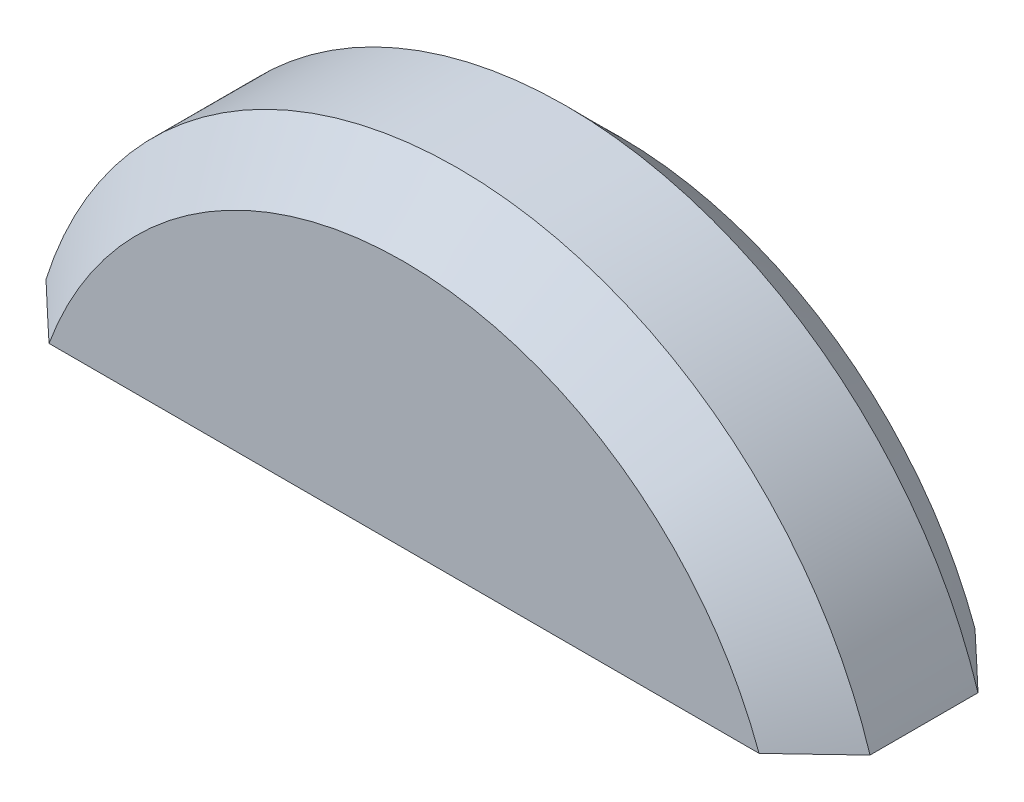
ISO-10303-21;
HEADER;
FILE_DESCRIPTION(('STEP AP214'),'2;1');
FILE_NAME('part.step','',(''),(''),'','','');
FILE_SCHEMA(('AUTOMOTIVE_DESIGN { 1 0 10303 214 1 1 1 1 }'));
ENDSEC;
DATA;
#1=APPLICATION_CONTEXT('core data for automotive mechanical design processes');
#2=APPLICATION_PROTOCOL_DEFINITION('international standard','automotive_design',2000,#1);
#3=PRODUCT_CONTEXT('',#1,'mechanical');
#4=PRODUCT('Part','Part','',(#3));
#5=PRODUCT_RELATED_PRODUCT_CATEGORY('part','',(#4));
#6=PRODUCT_DEFINITION_FORMATION('','',#4);
#7=PRODUCT_DEFINITION_CONTEXT('part definition',#1,'design');
#8=PRODUCT_DEFINITION('design','',#6,#7);
#9=PRODUCT_DEFINITION_SHAPE('','',#8);
#10=(LENGTH_UNIT() NAMED_UNIT(*) SI_UNIT(.MILLI.,.METRE.));
#11=(NAMED_UNIT(*) PLANE_ANGLE_UNIT() SI_UNIT($,.RADIAN.));
#12=(NAMED_UNIT(*) SI_UNIT($,.STERADIAN.) SOLID_ANGLE_UNIT());
#13=UNCERTAINTY_MEASURE_WITH_UNIT(LENGTH_MEASURE(1.E-05),#10,'distance_accuracy_value','');
#14=(GEOMETRIC_REPRESENTATION_CONTEXT(3) GLOBAL_UNCERTAINTY_ASSIGNED_CONTEXT((#13)) GLOBAL_UNIT_ASSIGNED_CONTEXT((#10,
#11,#12)) REPRESENTATION_CONTEXT('',''));
#15=CARTESIAN_POINT('',(0.,0.,0.));
#16=DIRECTION('',(0.,0.,1.));
#17=DIRECTION('',(1.,0.,0.));
#18=AXIS2_PLACEMENT_3D('',#15,#16,#17);
#19=CARTESIAN_POINT('',(0.,0.,1.));
#20=DIRECTION('',(0.,0.,-1.));
#21=DIRECTION('',(-1.,0.,0.));
#22=AXIS2_PLACEMENT_3D('',#19,#20,#21);
#23=CYLINDRICAL_SURFACE('',#22,2.);
#24=DIRECTION('',(0.,0.,-1.));
#25=VECTOR('',#24,1.);
#26=CARTESIAN_POINT('',(-1.90787840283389,0.600000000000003,1.));
#27=LINE('',#26,#25);
#28=CARTESIAN_POINT('',(-1.90787840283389,0.600000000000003,0.749999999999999));
#29=VERTEX_POINT('',#28);
#30=CARTESIAN_POINT('',(-1.90787840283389,0.600000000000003,0.250000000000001));
#31=VERTEX_POINT('',#30);
#32=EDGE_CURVE('E100',#29,#31,#27,.T.);
#33=ORIENTED_EDGE('',*,*,#32,.F.);
#34=CARTESIAN_POINT('',(0.,0.,0.749999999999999));
#35=DIRECTION('',(0.,0.,-1.));
#36=DIRECTION('',(-1.,0.,0.));
#37=AXIS2_PLACEMENT_3D('',#34,#35,#36);
#38=CIRCLE('',#37,2.);
#39=CARTESIAN_POINT('',(1.90787840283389,0.600000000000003,0.749999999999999));
#40=VERTEX_POINT('',#39);
#41=EDGE_CURVE('E51',#29,#40,#38,.T.);
#42=ORIENTED_EDGE('',*,*,#41,.T.);
#43=DIRECTION('',(0.,0.,-1.));
#44=VECTOR('',#43,1.);
#45=CARTESIAN_POINT('',(1.90787840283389,0.600000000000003,1.));
#46=LINE('',#45,#44);
#47=CARTESIAN_POINT('',(1.90787840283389,0.600000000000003,0.250000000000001));
#48=VERTEX_POINT('',#47);
#49=EDGE_CURVE('E104',#40,#48,#46,.T.);
#50=ORIENTED_EDGE('',*,*,#49,.T.);
#51=CARTESIAN_POINT('',(0.,0.,0.250000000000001));
#52=DIRECTION('',(0.,0.,-1.));
#53=DIRECTION('',(-1.,0.,0.));
#54=AXIS2_PLACEMENT_3D('',#51,#52,#53);
#55=CIRCLE('',#54,2.);
#56=EDGE_CURVE('E86',#48,#31,#55,.F.);
#57=ORIENTED_EDGE('',*,*,#56,.T.);
#58=EDGE_LOOP('',(#33,#42,#50,#57));
#59=FACE_BOUND('',#58,.T.);
#60=ADVANCED_FACE('F41',(#59),#23,.T.);
#61=CARTESIAN_POINT('',(-1.90787840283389,0.600000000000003,1.));
#62=DIRECTION('',(0.,1.,0.));
#63=DIRECTION('',(0.,0.,1.));
#64=AXIS2_PLACEMENT_3D('',#61,#62,#63);
#65=PLANE('',#64);
#66=DIRECTION('',(1.,0.,0.));
#67=VECTOR('',#66,1.);
#68=CARTESIAN_POINT('',(-1.90787840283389,0.600000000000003,1.));
#69=LINE('',#68,#67);
#70=CARTESIAN_POINT('',(-1.64392822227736,0.600000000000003,1.));
#71=VERTEX_POINT('',#70);
#72=CARTESIAN_POINT('',(1.64392822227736,0.600000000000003,1.));
#73=VERTEX_POINT('',#72);
#74=EDGE_CURVE('E98',#71,#73,#69,.T.);
#75=ORIENTED_EDGE('',*,*,#74,.F.);
#76=CARTESIAN_POINT('',(-1.64392822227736,0.600000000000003,1.));
#77=CARTESIAN_POINT('',(-1.68807902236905,0.600000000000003,0.958501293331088));
#78=CARTESIAN_POINT('',(-1.7321502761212,0.600000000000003,0.916918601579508));
#79=CARTESIAN_POINT('',(-1.82013366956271,0.600000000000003,0.833585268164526));
#80=CARTESIAN_POINT('',(-1.86404580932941,0.600000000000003,0.791834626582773));
#81=CARTESIAN_POINT('',(-1.90787840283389,0.600000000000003,0.749999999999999));
#82=B_SPLINE_CURVE_WITH_KNOTS('',3,(#76,#77,#78,#79,#80,#81),.UNSPECIFIED.,.F.,.F.,(4,2,4),(0.,
0.181776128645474,0.363552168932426),.UNSPECIFIED.);
#83=EDGE_CURVE('E68',#71,#29,#82,.T.);
#84=ORIENTED_EDGE('',*,*,#83,.T.);
#85=ORIENTED_EDGE('',*,*,#32,.T.);
#86=CARTESIAN_POINT('',(-1.90787840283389,0.600000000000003,0.250000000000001));
#87=CARTESIAN_POINT('',(-1.86404580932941,0.600000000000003,0.208165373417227));
#88=CARTESIAN_POINT('',(-1.82013366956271,0.600000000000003,0.166414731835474));
#89=CARTESIAN_POINT('',(-1.7321502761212,0.600000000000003,0.0830813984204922));
#90=CARTESIAN_POINT('',(-1.68807902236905,0.600000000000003,0.0414987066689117));
#91=CARTESIAN_POINT('',(-1.64392822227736,0.600000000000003,0.));
#92=B_SPLINE_CURVE_WITH_KNOTS('',3,(#86,#87,#88,#89,#90,#91),.UNSPECIFIED.,.F.,.F.,(4,2,4),(0.,
0.181776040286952,0.363552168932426),.UNSPECIFIED.);
#93=CARTESIAN_POINT('',(-1.64392822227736,0.600000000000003,0.));
#94=VERTEX_POINT('',#93);
#95=EDGE_CURVE('E59',#31,#94,#92,.T.);
#96=ORIENTED_EDGE('',*,*,#95,.T.);
#97=DIRECTION('',(1.,0.,0.));
#98=VECTOR('',#97,1.);
#99=CARTESIAN_POINT('',(-1.90787840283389,0.600000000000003,0.));
#100=LINE('',#99,#98);
#101=CARTESIAN_POINT('',(1.64392822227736,0.600000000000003,0.));
#102=VERTEX_POINT('',#101);
#103=EDGE_CURVE('E102',#94,#102,#100,.T.);
#104=ORIENTED_EDGE('',*,*,#103,.T.);
#105=CARTESIAN_POINT('',(1.64392822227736,0.600000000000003,0.));
#106=CARTESIAN_POINT('',(1.68807902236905,0.600000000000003,0.0414987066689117));
#107=CARTESIAN_POINT('',(1.7321502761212,0.600000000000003,0.0830813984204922));
#108=CARTESIAN_POINT('',(1.82013366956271,0.600000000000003,0.166414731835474));
#109=CARTESIAN_POINT('',(1.86404580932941,0.600000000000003,0.208165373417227));
#110=CARTESIAN_POINT('',(1.90787840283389,0.600000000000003,0.250000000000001));
#111=B_SPLINE_CURVE_WITH_KNOTS('',3,(#105,#106,#107,#108,#109,#110),.UNSPECIFIED.,.F.,.F.,(4,2,
4),(0.,0.181776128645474,0.363552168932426),.UNSPECIFIED.);
#112=EDGE_CURVE('E96',#102,#48,#111,.T.);
#113=ORIENTED_EDGE('',*,*,#112,.T.);
#114=ORIENTED_EDGE('',*,*,#49,.F.);
#115=CARTESIAN_POINT('',(1.90787840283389,0.600000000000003,0.749999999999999));
#116=CARTESIAN_POINT('',(1.86404580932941,0.600000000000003,0.791834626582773));
#117=CARTESIAN_POINT('',(1.82013366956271,0.600000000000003,0.833585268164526));
#118=CARTESIAN_POINT('',(1.7321502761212,0.600000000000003,0.916918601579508));
#119=CARTESIAN_POINT('',(1.68807902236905,0.600000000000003,0.958501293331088));
#120=CARTESIAN_POINT('',(1.64392822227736,0.600000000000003,1.));
#121=B_SPLINE_CURVE_WITH_KNOTS('',3,(#115,#116,#117,#118,#119,#120),.UNSPECIFIED.,.F.,.F.,(4,2,
4),(0.,0.181776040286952,0.363552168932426),.UNSPECIFIED.);
#122=EDGE_CURVE('E91',#40,#73,#121,.T.);
#123=ORIENTED_EDGE('',*,*,#122,.T.);
#124=EDGE_LOOP('',(#75,#84,#85,#96,#104,#113,#114,#123));
#125=FACE_BOUND('',#124,.T.);
#126=ADVANCED_FACE('F103',(#125),#65,.F.);
#127=CARTESIAN_POINT('',(0.,0.,1.));
#128=DIRECTION('',(0.,0.,-1.));
#129=DIRECTION('',(-1.,0.,0.));
#130=AXIS2_PLACEMENT_3D('',#127,#128,#129);
#131=PLANE('',#130);
#132=ORIENTED_EDGE('',*,*,#74,.T.);
#133=CARTESIAN_POINT('',(0.,0.,1.));
#134=DIRECTION('',(0.,0.,-1.));
#135=DIRECTION('',(-1.,0.,0.));
#136=AXIS2_PLACEMENT_3D('',#133,#134,#135);
#137=CIRCLE('',#136,1.75);
#138=EDGE_CURVE('E87',#73,#71,#137,.F.);
#139=ORIENTED_EDGE('',*,*,#138,.T.);
#140=EDGE_LOOP('',(#132,#139));
#141=FACE_BOUND('',#140,.T.);
#142=ADVANCED_FACE('F94',(#141),#131,.F.);
#143=CARTESIAN_POINT('',(0.,0.,0.));
#144=DIRECTION('',(0.,0.,-1.));
#145=DIRECTION('',(-1.,0.,0.));
#146=AXIS2_PLACEMENT_3D('',#143,#144,#145);
#147=PLANE('',#146);
#148=ORIENTED_EDGE('',*,*,#103,.F.);
#149=CARTESIAN_POINT('',(0.,0.,0.));
#150=DIRECTION('',(0.,0.,-1.));
#151=DIRECTION('',(-1.,0.,0.));
#152=AXIS2_PLACEMENT_3D('',#149,#150,#151);
#153=CIRCLE('',#152,1.75);
#154=EDGE_CURVE('E11',#94,#102,#153,.T.);
#155=ORIENTED_EDGE('',*,*,#154,.T.);
#156=EDGE_LOOP('',(#148,#155));
#157=FACE_BOUND('',#156,.T.);
#158=ADVANCED_FACE('F132',(#157),#147,.T.);
#159=CARTESIAN_POINT('',(0.,0.,1.));
#160=DIRECTION('',(0.,0.,-1.));
#161=DIRECTION('',(-1.,0.,0.));
#162=AXIS2_PLACEMENT_3D('',#159,#160,#161);
#163=CONICAL_SURFACE('',#162,1.75,0.785398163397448);
#164=ORIENTED_EDGE('',*,*,#122,.F.);
#165=ORIENTED_EDGE('',*,*,#41,.F.);
#166=ORIENTED_EDGE('',*,*,#83,.F.);
#167=ORIENTED_EDGE('',*,*,#138,.F.);
#168=EDGE_LOOP('',(#164,#165,#166,#167));
#169=FACE_BOUND('',#168,.T.);
#170=ADVANCED_FACE('F89',(#169),#163,.T.);
#171=CARTESIAN_POINT('',(0.,0.,0.250000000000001));
#172=DIRECTION('',(0.,0.,1.));
#173=DIRECTION('',(1.,0.,0.));
#174=AXIS2_PLACEMENT_3D('',#171,#172,#173);
#175=CONICAL_SURFACE('',#174,2.,0.785398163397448);
#176=ORIENTED_EDGE('',*,*,#112,.F.);
#177=ORIENTED_EDGE('',*,*,#154,.F.);
#178=ORIENTED_EDGE('',*,*,#95,.F.);
#179=ORIENTED_EDGE('',*,*,#56,.F.);
#180=EDGE_LOOP('',(#176,#177,#178,#179));
#181=FACE_BOUND('',#180,.T.);
#182=ADVANCED_FACE('F43',(#181),#175,.T.);
#183=CLOSED_SHELL('',(#60,#126,#142,#158,#170,#182));
#184=MANIFOLD_SOLID_BREP('B2',#183);
#185=ADVANCED_BREP_SHAPE_REPRESENTATION('',(#18,#184),#14);
#186=SHAPE_DEFINITION_REPRESENTATION(#9,#185);
ENDSEC;
END-ISO-10303-21;
